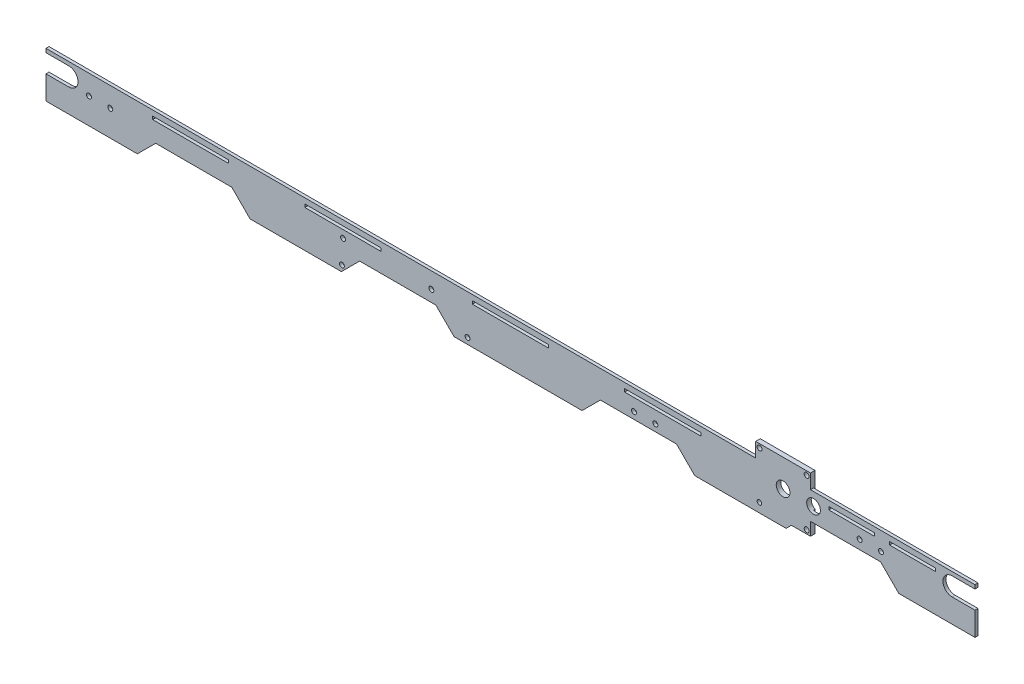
from build123d import *

# Parameters (mm, degrees)
SALIENTE_EXTRUIR1_DEPTH = 2
CROQUIS4_W              = 50
CROQUIS4_H              = 2
CORTAR_EXTRUIR1_DEPTH   = 5
CROQUIS6_R              = 4.5
CORTAR_EXTRUIR3_DEPTH   = 3
SALIENTE_EXTRUIR2_START = -3
CROQUIS7_W              = 36
CROQUIS7_H              = 36
CROQUIS7_R              = 4.5
CROQUIS7_R_2            = 1.625
SALIENTE_EXTRUIR2_DEPTH = 3
CROQUIS8_R              = 1.5
CROQUIS8_R_2            = 3.6
CORTAR_EXTRUIR4_DEPTH   = 3
CROQUIS10_W             = 10
CROQUIS10_H             = 30
SALIENTE_EXTRUIR3_DEPTH = 2
CROQUIS20_R             = 1.625
CORTAR_EXTRUIR15_DEPTH  = 10
CROQUIS21_R             = 1.625
CORTAR_EXTRUIR16_DEPTH  = 3
CROQUIS22_R             = 1.625
CORTAR_EXTRUIR17_DEPTH  = 3
CROQUIS23_R             = 1.625
CORTAR_EXTRUIR18_DEPTH  = 3
CORTAR_EXTRUIR20_DEPTH  = 3
CROQUIS29_R             = 4.5
CORTAR_EXTRUIR22_DEPTH  = 3
CROQUIS30_W             = 30
CROQUIS30_H             = 2
CORTAR_EXTRUIR23_DEPTH  = 3
SKETCH1_R               = 1.6
CUT_EXTRUDE1_DEPTH      = 5


with BuildPart() as part:
    # Croquis1 → Saliente-Extruir1 (new body)
    with BuildSketch(Plane.XY):
        Polygon((-300, 3), (300, 3), (300, -27), (250, -27), (238, -15), (188, -15), (176, -27), (116.02, -27), (104.02, -15), (54.02, -15), (42.02, -27), (-42.02, -27), (-54.02, -15), (-104.02, -15), (-116.02, -27), (-176, -27), (-188, -15), (-238, -15), (-250, -27), (-300, -27), align=None)
    extrude(amount=SALIENTE_EXTRUIR1_DEPTH)

    # Croquis4 → Cortar-Extruir1 (cut)
    with BuildSketch(Plane.XY.offset(2)):
        with Locations((-215, -1.5)):
            Rectangle(CROQUIS4_W, CROQUIS4_H)
        with Locations((-115, -1.5)):
            Rectangle(CROQUIS4_W, CROQUIS4_H)
        with Locations((-5, -1.5)):
            Rectangle(CROQUIS4_W, CROQUIS4_H)
        with Locations((95, -1.5)):
            Rectangle(CROQUIS4_W, CROQUIS4_H)
    extrude(amount=-CORTAR_EXTRUIR1_DEPTH, mode=Mode.SUBTRACT)

    # Croquis6 → Cortar-Extruir3 (cut)
    with BuildSketch(Plane(origin=(0, 0, 0), x_dir=(-1, 0, 0), z_dir=(0, 0, -1))):
        with Locations((-174, -5.5)):
            Circle(CROQUIS6_R)
    extrude(amount=-CORTAR_EXTRUIR3_DEPTH, mode=Mode.SUBTRACT)

    # Croquis7 → Saliente-Extruir2 (add)
    with BuildSketch(Plane.XY.offset(2).offset(SALIENTE_EXTRUIR2_START)):
        with Locations((174, -5.5)):
            Rectangle(CROQUIS7_W, CROQUIS7_H)
        with Locations(Location((174, -5.5, 0), (0, 0, 180))):
            Circle(CROQUIS7_R, mode=Mode.SUBTRACT)
        with Locations((158.5, 10)):
            Circle(CROQUIS7_R_2, mode=Mode.SUBTRACT)
        with Locations((189.5, 10)):
            Circle(CROQUIS7_R_2, mode=Mode.SUBTRACT)
        with Locations(Location((189.5, -21, 0), (0, 0, 180))):
            Circle(CROQUIS7_R_2, mode=Mode.SUBTRACT)
        with Locations(Location((158.5, -21, 0), (0, 0, 180))):
            Circle(CROQUIS7_R_2, mode=Mode.SUBTRACT)
    extrude(amount=SALIENTE_EXTRUIR2_DEPTH)

    # Croquis8 → Cortar-Extruir4 (cut)
    with BuildSketch(Plane.XY.offset(2)):
        with Locations((158.5, 10)):
            Circle(CROQUIS8_R)
        with Locations((174, -5.5)):
            Circle(CROQUIS8_R_2)
        with Locations(Location((158.5, -21, 0), (0, 0, 180))):
            Circle(CROQUIS8_R)
    extrude(amount=-CORTAR_EXTRUIR4_DEPTH, mode=Mode.SUBTRACT)

    # Croquis10 → Saliente-Extruir3 (add)
    with BuildSketch(Plane.XY.offset(2)):
        with Locations((-305, -12)):
            Rectangle(CROQUIS10_W, CROQUIS10_H)
    extrude(amount=-SALIENTE_EXTRUIR3_DEPTH)

    # Croquis20 → Cortar-Extruir15 (cut)
    with BuildSketch(Plane(origin=(0, 0, 0), x_dir=(-1, 0, 0), z_dir=(0, 0, -1))):
        with Locations((114.935059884, -7.5)):
            Circle(CROQUIS20_R)
        with Locations((56.935059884, -7.5)):
            Circle(CROQUIS20_R)
    extrude(amount=-CORTAR_EXTRUIR15_DEPTH, mode=Mode.SUBTRACT)

    # Croquis21 → Cortar-Extruir16 (cut)
    with BuildSketch(Plane(origin=(0, 0, 0), x_dir=(-1, 0, 0), z_dir=(0, 0, -1))):
        with Locations((-76.137704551, -10.499479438)):
            Circle(CROQUIS21_R)
        with Locations((-90.137704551, -10.499479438)):
            Circle(CROQUIS21_R)
    extrude(amount=-CORTAR_EXTRUIR16_DEPTH, mode=Mode.SUBTRACT)

    # Croquis22 → Cortar-Extruir17 (cut)
    with BuildSketch(Plane.XY.offset(2)):
        with Locations((224.273370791, -9)):
            Circle(CROQUIS22_R)
        with Locations((238.273370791, -9)):
            Circle(CROQUIS22_R)
    extrude(amount=-CORTAR_EXTRUIR17_DEPTH, mode=Mode.SUBTRACT)

    # Croquis23 → Cortar-Extruir18 (cut)
    with BuildSketch(Plane.XY.offset(2)):
        with Locations((-281.772260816, -10)):
            Circle(CROQUIS23_R)
        with Locations((-267.772260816, -10)):
            Circle(CROQUIS23_R)
    extrude(amount=-CORTAR_EXTRUIR18_DEPTH, mode=Mode.SUBTRACT)

    # Croquis25 → Cortar-Extruir20 (cut)
    with BuildSketch(Plane.XY.offset(2)):
        with BuildLine():
            Line((-295, 0.5), (-310, 0.5))
            Line((-310, 0.5), (-310, -11.5))
            Line((-310, -11.5), (-295, -11.5))
            ThreePointArc((-295, -11.5), (-289, -5.5), (-295, 0.5))
        make_face()
        with BuildLine():
            Line((300, -11.5), (285, -11.5))
            ThreePointArc((285, -11.5), (279, -5.5), (285, 0.5))
            Line((285, 0.5), (300, 0.5))
            Line((300, 0.5), (300, -11.5))
        make_face()
    extrude(amount=-CORTAR_EXTRUIR20_DEPTH, mode=Mode.SUBTRACT)

    # Croquis29 → Cortar-Extruir22 (cut)
    with BuildSketch(Plane.XY.offset(2)):
        with Locations((194, -5.5)):
            Circle(CROQUIS29_R)
    extrude(amount=-CORTAR_EXTRUIR22_DEPTH, mode=Mode.SUBTRACT)

    # Croquis30 → Cortar-Extruir23 (cut)
    with BuildSketch(Plane(origin=(0, 0, 0), x_dir=(-1, 0, 0), z_dir=(0, 0, -1))):
        with Locations((-259, -1.5)):
            Rectangle(CROQUIS30_W, CROQUIS30_H)
        with Locations((-219, -1.5)):
            Rectangle(CROQUIS30_W, CROQUIS30_H)
    extrude(amount=-CORTAR_EXTRUIR23_DEPTH, mode=Mode.SUBTRACT)

    # Sketch1 → Cut-Extrude1 (cut)
    with BuildSketch(Plane.XY.offset(2)):
        with Locations((-33.190713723, -23)):
            Circle(SKETCH1_R)
        with Locations((-115.65020331, -23)):
            Circle(SKETCH1_R)
    extrude(amount=-CUT_EXTRUDE1_DEPTH, mode=Mode.SUBTRACT)


solid = part.part
